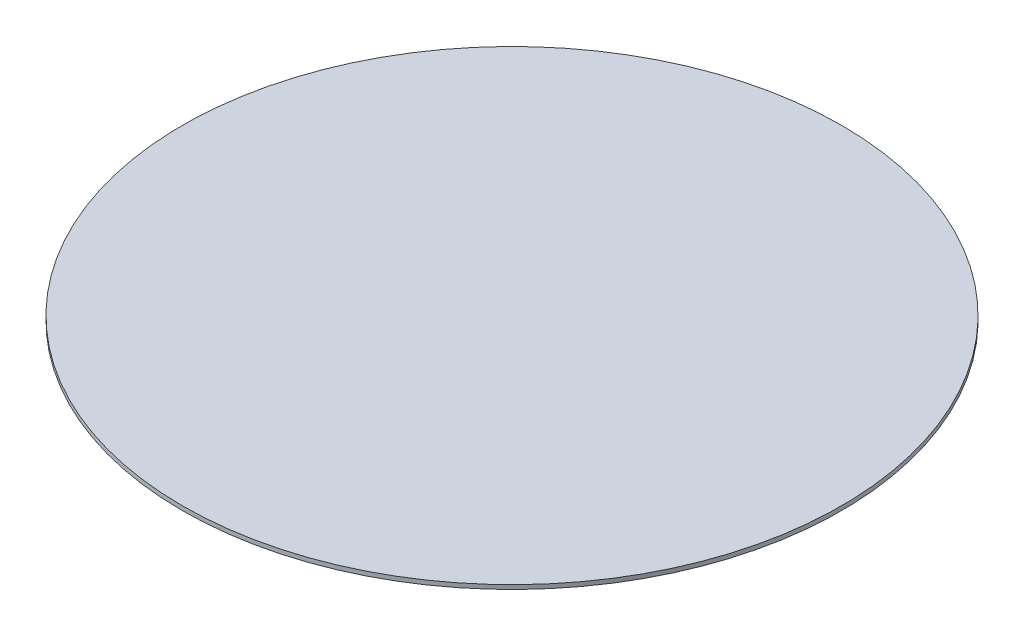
from build123d import *

# Parameters (mm, degrees)
SKETCH1_R           = 23.5
BOSS_EXTRUDE1_DEPTH = 0.3


with BuildPart() as part:
    # Sketch1 → Boss-Extrude1 (new body)
    with BuildSketch(Plane(origin=(0, 0, 0), x_dir=(1, 0, 0), z_dir=(0, 1, 0))):
        with Locations(Location((0, 0, 0), (0, 0, 270))):
            Circle(SKETCH1_R)
    extrude(amount=BOSS_EXTRUDE1_DEPTH)


solid = part.part
